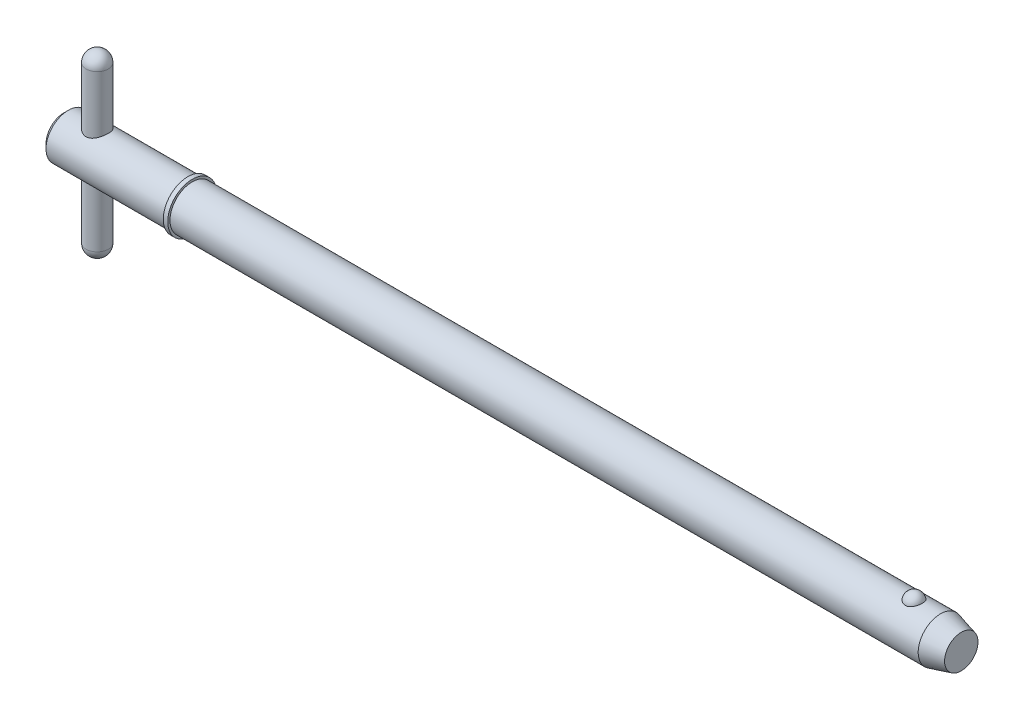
ISO-10303-21;
HEADER;
FILE_DESCRIPTION(('STEP AP214'),'2;1');
FILE_NAME('part.step','',(''),(''),'','','');
FILE_SCHEMA(('AUTOMOTIVE_DESIGN { 1 0 10303 214 1 1 1 1 }'));
ENDSEC;
DATA;
#1=APPLICATION_CONTEXT('core data for automotive mechanical design processes');
#2=APPLICATION_PROTOCOL_DEFINITION('international standard','automotive_design',2000,#1);
#3=PRODUCT_CONTEXT('',#1,'mechanical');
#4=PRODUCT('Part','Part','',(#3));
#5=PRODUCT_RELATED_PRODUCT_CATEGORY('part','',(#4));
#6=PRODUCT_DEFINITION_FORMATION('','',#4);
#7=PRODUCT_DEFINITION_CONTEXT('part definition',#1,'design');
#8=PRODUCT_DEFINITION('design','',#6,#7);
#9=PRODUCT_DEFINITION_SHAPE('','',#8);
#10=(LENGTH_UNIT() NAMED_UNIT(*) SI_UNIT(.MILLI.,.METRE.));
#11=(NAMED_UNIT(*) PLANE_ANGLE_UNIT() SI_UNIT($,.RADIAN.));
#12=(NAMED_UNIT(*) SI_UNIT($,.STERADIAN.) SOLID_ANGLE_UNIT());
#13=UNCERTAINTY_MEASURE_WITH_UNIT(LENGTH_MEASURE(1.E-05),#10,'distance_accuracy_value','');
#14=(GEOMETRIC_REPRESENTATION_CONTEXT(3) GLOBAL_UNCERTAINTY_ASSIGNED_CONTEXT((#13)) GLOBAL_UNIT_ASSIGNED_CONTEXT((#10,
#11,#12)) REPRESENTATION_CONTEXT('',''));
#15=CARTESIAN_POINT('',(0.,0.,0.));
#16=DIRECTION('',(0.,0.,1.));
#17=DIRECTION('',(1.,0.,0.));
#18=AXIS2_PLACEMENT_3D('',#15,#16,#17);
#19=CARTESIAN_POINT('',(4.755,12.7,0.));
#20=DIRECTION('',(0.,-1.,0.));
#21=DIRECTION('',(0.,0.,-1.));
#22=AXIS2_PLACEMENT_3D('',#19,#20,#21);
#23=CYLINDRICAL_SURFACE('',#22,1.585);
#24=CARTESIAN_POINT('',(4.755,-11.115,0.));
#25=DIRECTION('',(0.,-1.,0.));
#26=DIRECTION('',(0.,0.,-1.));
#27=AXIS2_PLACEMENT_3D('',#24,#25,#26);
#28=CIRCLE('',#27,1.585);
#29=CARTESIAN_POINT('',(4.755,-11.115,-1.585));
#30=VERTEX_POINT('',#29);
#31=EDGE_CURVE('P0_E10',#30,#30,#28,.F.);
#32=ORIENTED_EDGE('',*,*,#31,.T.);
#33=EDGE_LOOP('',(#32));
#34=FACE_BOUND('',#33,.T.);
#35=CARTESIAN_POINT('',(4.755,11.115,0.));
#36=DIRECTION('',(0.,-1.,0.));
#37=DIRECTION('',(0.,0.,-1.));
#38=AXIS2_PLACEMENT_3D('',#35,#36,#37);
#39=CIRCLE('',#38,1.585);
#40=CARTESIAN_POINT('',(4.755,11.115,-1.585));
#41=VERTEX_POINT('',#40);
#42=EDGE_CURVE('P0_E21',#41,#41,#39,.T.);
#43=ORIENTED_EDGE('',*,*,#42,.T.);
#44=EDGE_LOOP('',(#43));
#45=FACE_BOUND('',#44,.T.);
#46=ADVANCED_FACE('P0_F14',(#34,#45),#23,.T.);
#47=CARTESIAN_POINT('',(4.755,-11.115,0.));
#48=DIRECTION('',(0.,0.,1.));
#49=DIRECTION('',(1.,0.,0.));
#50=AXIS2_PLACEMENT_3D('',#47,#48,#49);
#51=SPHERICAL_SURFACE('',#50,1.585);
#52=CARTESIAN_POINT('',(4.755,-11.115,0.));
#53=DIRECTION('',(0.,-1.,0.));
#54=DIRECTION('',(0.,0.,-1.));
#55=AXIS2_PLACEMENT_3D('',#52,#53,#54);
#56=SPHERICAL_SURFACE('',#55,1.585);
#57=ORIENTED_EDGE('',*,*,#31,.F.);
#58=EDGE_LOOP('',(#57));
#59=FACE_BOUND('',#58,.T.);
#60=ADVANCED_FACE('P0_F29',(#59),#56,.T.);
#61=CARTESIAN_POINT('',(4.755,11.115,0.));
#62=DIRECTION('',(0.,0.,1.));
#63=DIRECTION('',(1.,0.,0.));
#64=AXIS2_PLACEMENT_3D('',#61,#62,#63);
#65=SPHERICAL_SURFACE('',#64,1.585);
#66=CARTESIAN_POINT('',(4.755,11.115,0.));
#67=DIRECTION('',(0.,-1.,0.));
#68=DIRECTION('',(0.,0.,-1.));
#69=AXIS2_PLACEMENT_3D('',#66,#67,#68);
#70=SPHERICAL_SURFACE('',#69,1.585);
#71=ORIENTED_EDGE('',*,*,#42,.F.);
#72=EDGE_LOOP('',(#71));
#73=FACE_BOUND('',#72,.T.);
#74=ADVANCED_FACE('P0_F16',(#73),#70,.T.);
#75=CLOSED_SHELL('',(#46,#60,#74));
#76=MANIFOLD_SOLID_BREP('P0_B1',#75);
#77=CARTESIAN_POINT('',(0.,0.,0.));
#78=DIRECTION('',(1.,0.,0.));
#79=DIRECTION('',(0.,0.,-1.));
#80=AXIS2_PLACEMENT_3D('',#77,#78,#79);
#81=CYLINDRICAL_SURFACE('',#80,3.175);
#82=CARTESIAN_POINT('',(124.847684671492,0.,0.));
#83=DIRECTION('',(1.,0.,0.));
#84=DIRECTION('',(0.,0.,-1.));
#85=AXIS2_PLACEMENT_3D('',#82,#83,#84);
#86=CIRCLE('',#85,3.175);
#87=CARTESIAN_POINT('',(124.847684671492,0.,-3.175));
#88=VERTEX_POINT('',#87);
#89=EDGE_CURVE('P1_E81',#88,#88,#86,.T.);
#90=ORIENTED_EDGE('',*,*,#89,.F.);
#91=EDGE_LOOP('',(#90));
#92=FACE_BOUND('',#91,.T.);
#93=CARTESIAN_POINT('',(18.29,0.,0.));
#94=DIRECTION('',(1.,0.,0.));
#95=DIRECTION('',(0.,0.,-1.));
#96=AXIS2_PLACEMENT_3D('',#93,#94,#95);
#97=CIRCLE('',#96,3.175);
#98=CARTESIAN_POINT('',(18.29,0.,-3.175));
#99=VERTEX_POINT('',#98);
#100=EDGE_CURVE('P1_E85',#99,#99,#97,.T.);
#101=ORIENTED_EDGE('',*,*,#100,.T.);
#102=EDGE_LOOP('',(#101));
#103=FACE_BOUND('',#102,.T.);
#104=CARTESIAN_POINT('',(121.07572762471,2.92898950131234,1.22541646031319));
#105=CARTESIAN_POINT('',(121.012316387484,2.92899434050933,1.22541146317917));
#106=CARTESIAN_POINT('',(120.948797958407,2.93112688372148,1.22034641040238));
#107=CARTESIAN_POINT('',(120.823530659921,2.93942752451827,1.20020949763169));
#108=CARTESIAN_POINT('',(120.761786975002,2.94560639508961,1.18511092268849));
#109=CARTESIAN_POINT('',(120.642065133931,2.96127115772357,1.1454035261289));
#110=CARTESIAN_POINT('',(120.584077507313,2.97074831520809,1.1208198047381));
#111=CARTESIAN_POINT('',(120.473194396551,2.99197584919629,1.06285154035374));
#112=CARTESIAN_POINT('',(120.420296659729,3.0037252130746,1.02947091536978));
#113=CARTESIAN_POINT('',(120.319268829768,3.02865714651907,0.953674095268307));
#114=CARTESIAN_POINT('',(120.271324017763,3.04187163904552,0.911021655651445));
#115=CARTESIAN_POINT('',(120.183036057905,3.06808741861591,0.8184003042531));
#116=CARTESIAN_POINT('',(120.142695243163,3.08108863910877,0.768429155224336));
#117=CARTESIAN_POINT('',(120.068803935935,3.10614903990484,0.660064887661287));
#118=CARTESIAN_POINT('',(120.035633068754,3.11814104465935,0.601396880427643));
#119=CARTESIAN_POINT('',(119.979119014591,3.13926931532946,0.479026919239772));
#120=CARTESIAN_POINT('',(119.955776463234,3.14840539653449,0.415324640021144));
#121=CARTESIAN_POINT('',(119.919178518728,3.16298160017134,0.283885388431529));
#122=CARTESIAN_POINT('',(119.906040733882,3.16837855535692,0.216110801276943));
#123=CARTESIAN_POINT('',(119.890567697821,3.17475386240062,0.079136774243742));
#124=CARTESIAN_POINT('',(119.888232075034,3.17573236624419,0.00993738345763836));
#125=CARTESIAN_POINT('',(119.894388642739,3.17318075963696,-0.127420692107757));
#126=CARTESIAN_POINT('',(119.902807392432,3.16968122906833,-0.195583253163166));
#127=CARTESIAN_POINT('',(119.930175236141,3.1585790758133,-0.32941342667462));
#128=CARTESIAN_POINT('',(119.949124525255,3.15097637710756,-0.395080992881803));
#129=CARTESIAN_POINT('',(119.997205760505,3.13242485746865,-0.522180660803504));
#130=CARTESIAN_POINT('',(120.026352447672,3.12147119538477,-0.583606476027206));
#131=CARTESIAN_POINT('',(120.094235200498,3.09734973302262,-0.700436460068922));
#132=CARTESIAN_POINT('',(120.132972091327,3.08418174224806,-0.755840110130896));
#133=CARTESIAN_POINT('',(120.219477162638,3.05694884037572,-0.859404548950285));
#134=CARTESIAN_POINT('',(120.267296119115,3.04287919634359,-0.907521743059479));
#135=CARTESIAN_POINT('',(120.370735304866,3.01548927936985,-0.994758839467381));
#136=CARTESIAN_POINT('',(120.426354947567,3.0021689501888,-1.03387941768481));
#137=CARTESIAN_POINT('',(120.542809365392,2.97810316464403,-1.10126594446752));
#138=CARTESIAN_POINT('',(120.603518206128,2.96731170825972,-1.12973256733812));
#139=CARTESIAN_POINT('',(120.729371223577,2.94928934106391,-1.17598467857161));
#140=CARTESIAN_POINT('',(120.794513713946,2.94205708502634,-1.19377420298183));
#141=CARTESIAN_POINT('',(120.923856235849,2.93233065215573,-1.21746387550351));
#142=CARTESIAN_POINT('',(120.987938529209,2.92961621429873,-1.22391763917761));
#143=CARTESIAN_POINT('',(121.116337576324,2.92855752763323,-1.22644976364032));
#144=CARTESIAN_POINT('',(121.180654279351,2.93021238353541,-1.22253024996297));
#145=CARTESIAN_POINT('',(121.305523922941,2.93756851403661,-1.20474140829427));
#146=CARTESIAN_POINT('',(121.366131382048,2.94313790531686,-1.1911962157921));
#147=CARTESIAN_POINT('',(121.484110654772,2.95756226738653,-1.15491492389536));
#148=CARTESIAN_POINT('',(121.541482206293,2.96641750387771,-1.13217808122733));
#149=CARTESIAN_POINT('',(121.652769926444,2.98669918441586,-1.07755083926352));
#150=CARTESIAN_POINT('',(121.706584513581,2.9981771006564,-1.04547308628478));
#151=CARTESIAN_POINT('',(121.808147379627,3.02240235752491,-0.973220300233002));
#152=CARTESIAN_POINT('',(121.855894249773,3.03514999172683,-0.933043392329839));
#153=CARTESIAN_POINT('',(121.946581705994,3.06131230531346,-0.843372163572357));
#154=CARTESIAN_POINT('',(121.989158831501,3.07472822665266,-0.793510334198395));
#155=CARTESIAN_POINT('',(122.065676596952,3.10021106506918,-0.687241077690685));
#156=CARTESIAN_POINT('',(122.099615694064,3.1122777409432,-0.630832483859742));
#157=CARTESIAN_POINT('',(122.159120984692,3.134208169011,-0.511059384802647));
#158=CARTESIAN_POINT('',(122.184389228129,3.14399040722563,-0.447531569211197));
#159=CARTESIAN_POINT('',(122.224511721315,3.15983820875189,-0.316827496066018));
#160=CARTESIAN_POINT('',(122.239365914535,3.16590375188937,-0.249651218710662));
#161=CARTESIAN_POINT('',(122.258358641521,3.17370076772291,-0.113549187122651));
#162=CARTESIAN_POINT('',(122.262496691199,3.17543204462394,-0.0446233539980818));
#163=CARTESIAN_POINT('',(122.259969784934,3.17438372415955,0.09299382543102));
#164=CARTESIAN_POINT('',(122.253305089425,3.17160423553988,0.16168517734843));
#165=CARTESIAN_POINT('',(122.229375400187,3.1618438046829,0.296502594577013));
#166=CARTESIAN_POINT('',(122.212167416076,3.15488546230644,0.362640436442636));
#167=CARTESIAN_POINT('',(122.167547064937,3.13748892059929,0.490896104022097));
#168=CARTESIAN_POINT('',(122.140133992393,3.12705048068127,0.553013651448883));
#169=CARTESIAN_POINT('',(122.075462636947,3.10369139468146,0.671876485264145));
#170=CARTESIAN_POINT('',(122.038146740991,3.0907563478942,0.728587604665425));
#171=CARTESIAN_POINT('',(121.954524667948,3.06381731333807,0.83465359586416));
#172=CARTESIAN_POINT('',(121.908218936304,3.04981337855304,0.884008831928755));
#173=CARTESIAN_POINT('',(121.807718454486,3.02230423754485,0.973916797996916));
#174=CARTESIAN_POINT('',(121.753535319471,3.00879833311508,1.01448227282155));
#175=CARTESIAN_POINT('',(121.638529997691,2.98383625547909,1.08571550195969));
#176=CARTESIAN_POINT('',(121.577705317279,2.97238085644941,1.11637952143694));
#177=CARTESIAN_POINT('',(121.453369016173,2.95329063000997,1.16592590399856));
#178=CARTESIAN_POINT('',(121.390023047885,2.94553738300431,1.1851790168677));
#179=CARTESIAN_POINT('',(121.26076644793,2.9342556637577,1.2128480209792));
#180=CARTESIAN_POINT('',(121.194864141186,2.93071450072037,1.22129647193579));
#181=CARTESIAN_POINT('',(121.111116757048,2.9291525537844,1.22502505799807));
#182=CARTESIAN_POINT('',(121.093426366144,2.9289881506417,1.22541785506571));
#183=CARTESIAN_POINT('',(121.07572762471,2.92898950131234,1.22541646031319));
#184=B_SPLINE_CURVE_WITH_KNOTS('',3,(#104,#105,#106,#107,#108,#109,#110,#111,#112,#113,#114,
#115,#116,#117,#118,#119,#120,#121,#122,#123,#124,#125,#126,#127,#128,#129,#130,#131,#132,#133,
#134,#135,#136,#137,#138,#139,#140,#141,#142,#143,#144,#145,#146,#147,#148,#149,#150,#151,#152,
#153,#154,#155,#156,#157,#158,#159,#160,#161,#162,#163,#164,#165,#166,#167,#168,#169,#170,#171,
#172,#173,#174,#175,#176,#177,#178,#179,#180,#181,#182,#183),.UNSPECIFIED.,.T.,.F.,(4,2,2,2,2,2,
2,2,2,2,2,2,2,2,2,2,2,2,2,2,2,2,2,2,2,2,2,2,2,2,2,2,2,2,2,2,2,2,2,4),(0.,0.19018620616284,
0.380880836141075,0.571074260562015,0.76118311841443,0.956866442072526,1.1526097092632,
1.35701770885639,1.56143892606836,1.76818248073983,1.9749189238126,2.18025109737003,
2.3855870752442,2.59122111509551,2.79687285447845,3.00371012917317,3.21053185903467,
3.41323429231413,3.61586005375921,3.80828192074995,4.0006643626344,4.18685798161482,
4.37306665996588,4.56330302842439,4.75358348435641,4.95345287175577,5.1533579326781,
5.3595700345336,5.56578325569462,5.77200579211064,5.97822335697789,6.18333558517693,
6.38846199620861,6.59480900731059,6.80114579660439,7.00718137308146,7.21329457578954,
7.41228022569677,7.61066481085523,7.66374777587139),.UNSPECIFIED.);
#185=CARTESIAN_POINT('',(121.07572762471,2.92898950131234,1.22541646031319));
#186=VERTEX_POINT('',#185);
#187=EDGE_CURVE('P1_E35',#186,#186,#184,.T.);
#188=ORIENTED_EDGE('',*,*,#187,.T.);
#189=EDGE_LOOP('',(#188));
#190=FACE_BOUND('',#189,.T.);
#191=ADVANCED_FACE('P1_F13',(#92,#103,#190),#81,.T.);
#192=CARTESIAN_POINT('',(0.,0.,0.));
#193=DIRECTION('',(-1.,0.,0.));
#194=DIRECTION('',(0.,0.,1.));
#195=AXIS2_PLACEMENT_3D('',#192,#193,#194);
#196=PLANE('',#195);
#197=CARTESIAN_POINT('',(0.,0.,0.));
#198=DIRECTION('',(1.,0.,0.));
#199=DIRECTION('',(0.,0.,-1.));
#200=AXIS2_PLACEMENT_3D('',#197,#198,#199);
#201=CIRCLE('',#200,2.54);
#202=CARTESIAN_POINT('',(0.,0.,-2.54));
#203=VERTEX_POINT('',#202);
#204=EDGE_CURVE('P1_E9',#203,#203,#201,.T.);
#205=ORIENTED_EDGE('',*,*,#204,.F.);
#206=EDGE_LOOP('',(#205));
#207=FACE_BOUND('',#206,.T.);
#208=ADVANCED_FACE('P1_F15',(#207),#196,.T.);
#209=CARTESIAN_POINT('',(0.634999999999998,0.,0.));
#210=DIRECTION('',(1.,0.,0.));
#211=DIRECTION('',(0.,0.,-1.));
#212=AXIS2_PLACEMENT_3D('',#209,#210,#211);
#213=CONICAL_SURFACE('',#212,3.175,0.78539816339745);
#214=ORIENTED_EDGE('',*,*,#204,.T.);
#215=EDGE_LOOP('',(#214));
#216=FACE_BOUND('',#215,.T.);
#217=CARTESIAN_POINT('',(0.634999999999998,0.,0.));
#218=DIRECTION('',(1.,0.,0.));
#219=DIRECTION('',(0.,0.,-1.));
#220=AXIS2_PLACEMENT_3D('',#217,#218,#219);
#221=CIRCLE('',#220,3.175);
#222=CARTESIAN_POINT('',(0.634999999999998,0.,-3.175));
#223=VERTEX_POINT('',#222);
#224=EDGE_CURVE('P1_E26',#223,#223,#221,.T.);
#225=ORIENTED_EDGE('',*,*,#224,.F.);
#226=EDGE_LOOP('',(#225));
#227=FACE_BOUND('',#226,.T.);
#228=ADVANCED_FACE('P1_F77',(#216,#227),#213,.T.);
#229=CARTESIAN_POINT('',(0.,0.,0.));
#230=DIRECTION('',(1.,0.,0.));
#231=DIRECTION('',(0.,0.,-1.));
#232=AXIS2_PLACEMENT_3D('',#229,#230,#231);
#233=CYLINDRICAL_SURFACE('',#232,3.175);
#234=CARTESIAN_POINT('',(4.755,-2.75107251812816,1.585));
#235=CARTESIAN_POINT('',(4.67238891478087,-2.7510796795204,1.58499425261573));
#236=CARTESIAN_POINT('',(4.58967306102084,-2.75485010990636,1.57849830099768));
#237=CARTESIAN_POINT('',(4.42677850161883,-2.76938647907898,1.55284486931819));
#238=CARTESIAN_POINT('',(4.34660551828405,-2.78016716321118,1.53366069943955));
#239=CARTESIAN_POINT('',(4.19146029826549,-2.80716278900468,1.48366329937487));
#240=CARTESIAN_POINT('',(4.11646293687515,-2.8233488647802,1.45291173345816));
#241=CARTESIAN_POINT('',(3.97271079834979,-2.85928672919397,1.38084067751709));
#242=CARTESIAN_POINT('',(3.90395634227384,-2.87903870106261,1.33952064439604));
#243=CARTESIAN_POINT('',(3.76839976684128,-2.921867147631,1.24350234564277));
#244=CARTESIAN_POINT('',(3.702222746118,-2.94508343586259,1.18798355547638));
#245=CARTESIAN_POINT('',(3.5796334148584,-2.99109588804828,1.06685014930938));
#246=CARTESIAN_POINT('',(3.52322596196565,-3.01389183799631,1.00123054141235));
#247=CARTESIAN_POINT('',(3.41807024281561,-3.05832598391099,0.856373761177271));
#248=CARTESIAN_POINT('',(3.37009053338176,-3.07978367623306,0.776518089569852));
#249=CARTESIAN_POINT('',(3.28853137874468,-3.11730894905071,0.608596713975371));
#250=CARTESIAN_POINT('',(3.25494287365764,-3.1333799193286,0.520536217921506));
#251=CARTESIAN_POINT('',(3.20559401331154,-3.15731341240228,0.345327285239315));
#252=CARTESIAN_POINT('',(3.18873760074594,-3.16567752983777,0.258557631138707));
#253=CARTESIAN_POINT('',(3.16972238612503,-3.17512718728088,0.0830496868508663));
#254=CARTESIAN_POINT('',(3.16755472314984,-3.17621711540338,-0.00568738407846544));
#255=CARTESIAN_POINT('',(3.1775542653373,-3.17123385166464,-0.174372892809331));
#256=CARTESIAN_POINT('',(3.18849502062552,-3.16577346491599,-0.254416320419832));
#257=CARTESIAN_POINT('',(3.22220680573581,-3.14922844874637,-0.411354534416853));
#258=CARTESIAN_POINT('',(3.2449787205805,-3.13814339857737,-0.488249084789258));
#259=CARTESIAN_POINT('',(3.30185558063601,-3.111172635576,-0.638050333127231));
#260=CARTESIAN_POINT('',(3.33611332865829,-3.09522247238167,-0.710886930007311));
#261=CARTESIAN_POINT('',(3.41477890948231,-3.05996035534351,-0.849953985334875));
#262=CARTESIAN_POINT('',(3.45919037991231,-3.04064719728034,-0.916182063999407));
#263=CARTESIAN_POINT('',(3.5617148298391,-2.99832415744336,-1.04681642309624));
#264=CARTESIAN_POINT('',(3.62072497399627,-2.97513741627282,-1.11046186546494));
#265=CARTESIAN_POINT('',(3.7483697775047,-2.92885066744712,-1.22736291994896));
#266=CARTESIAN_POINT('',(3.81701173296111,-2.90575073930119,-1.2806105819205));
#267=CARTESIAN_POINT('',(3.96727993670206,-2.86067370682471,-1.37849835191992));
#268=CARTESIAN_POINT('',(4.04945242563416,-2.83885964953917,-1.42238246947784));
#269=CARTESIAN_POINT('',(4.2213558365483,-2.80110454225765,-1.49537418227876));
#270=CARTESIAN_POINT('',(4.3110787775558,-2.78515738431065,-1.52449715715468));
#271=CARTESIAN_POINT('',(4.48806324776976,-2.76271292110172,-1.56478065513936));
#272=CARTESIAN_POINT('',(4.57495732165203,-2.75556745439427,-1.57718067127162));
#273=CARTESIAN_POINT('',(4.74985771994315,-2.74969306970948,-1.58740564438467));
#274=CARTESIAN_POINT('',(4.8378632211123,-2.75095824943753,-1.58524082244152));
#275=CARTESIAN_POINT('',(5.00227282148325,-2.76107477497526,-1.56753530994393));
#276=CARTESIAN_POINT('',(5.07889680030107,-2.76908515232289,-1.55347662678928));
#277=CARTESIAN_POINT('',(5.22855309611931,-2.79054849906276,-1.51458035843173));
#278=CARTESIAN_POINT('',(5.30158424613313,-2.80400322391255,-1.489739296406));
#279=CARTESIAN_POINT('',(5.44583114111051,-2.83556995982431,-1.42877335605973));
#280=CARTESIAN_POINT('',(5.51680600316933,-2.85386886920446,-1.39217900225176));
#281=CARTESIAN_POINT('',(5.6520174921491,-2.89289503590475,-1.30915485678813));
#282=CARTESIAN_POINT('',(5.71625063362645,-2.91362353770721,-1.26272001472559));
#283=CARTESIAN_POINT('',(5.8445938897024,-2.95830220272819,-1.15451693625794));
#284=CARTESIAN_POINT('',(5.90767560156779,-2.98233004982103,-1.09155543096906));
#285=CARTESIAN_POINT('',(6.0226995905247,-3.02864458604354,-0.955560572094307));
#286=CARTESIAN_POINT('',(6.07463814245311,-3.05093069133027,-0.882523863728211));
#287=CARTESIAN_POINT('',(6.16704288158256,-3.09200671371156,-0.725836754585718));
#288=CARTESIAN_POINT('',(6.20717458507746,-3.11069030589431,-0.64195924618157));
#289=CARTESIAN_POINT('',(6.27235859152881,-3.1416474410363,-0.467442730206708));
#290=CARTESIAN_POINT('',(6.29742409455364,-3.15392659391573,-0.376809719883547));
#291=CARTESIAN_POINT('',(6.32960989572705,-3.16979844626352,-0.200314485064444));
#292=CARTESIAN_POINT('',(6.33816324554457,-3.17408359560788,-0.114775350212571));
#293=CARTESIAN_POINT('',(6.34130309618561,-3.17565001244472,0.0566108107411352));
#294=CARTESIAN_POINT('',(6.33589445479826,-3.17293371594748,0.142457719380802));
#295=CARTESIAN_POINT('',(6.31221457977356,-3.16120608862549,0.306097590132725));
#296=CARTESIAN_POINT('',(6.2948097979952,-3.15261910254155,0.38404960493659));
#297=CARTESIAN_POINT('',(6.24879775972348,-3.13040364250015,0.535801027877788));
#298=CARTESIAN_POINT('',(6.22018889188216,-3.11677444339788,0.609599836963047));
#299=CARTESIAN_POINT('',(6.15130303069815,-3.08497808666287,0.754502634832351));
#300=CARTESIAN_POINT('',(6.11057850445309,-3.0666414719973,0.82535556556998));
#301=CARTESIAN_POINT('',(6.01917980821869,-3.02735012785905,0.95951596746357));
#302=CARTESIAN_POINT('',(5.96850106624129,-3.00639419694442,1.02281994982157));
#303=CARTESIAN_POINT('',(5.8528006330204,-2.96149402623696,1.1467073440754));
#304=CARTESIAN_POINT('',(5.78685463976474,-2.93745961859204,1.20639723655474));
#305=CARTESIAN_POINT('',(5.64552278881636,-2.89084502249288,1.31419099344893));
#306=CARTESIAN_POINT('',(5.57012871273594,-2.8682661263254,1.36228466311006));
#307=CARTESIAN_POINT('',(5.40892145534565,-2.82661780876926,1.44677201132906));
#308=CARTESIAN_POINT('',(5.32285703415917,-2.80767948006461,1.48275497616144));
#309=CARTESIAN_POINT('',(5.14469010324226,-2.77716572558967,1.53916557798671));
#310=CARTESIAN_POINT('',(5.05260892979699,-2.76556569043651,1.55964525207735));
#311=CARTESIAN_POINT('',(4.92544162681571,-2.75613775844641,1.57618070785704));
#312=CARTESIAN_POINT('',(4.89147210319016,-2.75424493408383,1.57948285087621));
#313=CARTESIAN_POINT('',(4.82334103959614,-2.75171079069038,1.58389375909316));
#314=CARTESIAN_POINT('',(4.78917948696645,-2.75106955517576,1.58500237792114));
#315=CARTESIAN_POINT('',(4.755,-2.75107251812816,1.585));
#316=B_SPLINE_CURVE_WITH_KNOTS('',3,(#234,#235,#236,#237,#238,#239,#240,#241,#242,#243,#244,
#245,#246,#247,#248,#249,#250,#251,#252,#253,#254,#255,#256,#257,#258,#259,#260,#261,#262,#263,
#264,#265,#266,#267,#268,#269,#270,#271,#272,#273,#274,#275,#276,#277,#278,#279,#280,#281,#282,
#283,#284,#285,#286,#287,#288,#289,#290,#291,#292,#293,#294,#295,#296,#297,#298,#299,#300,#301,
#302,#303,#304,#305,#306,#307,#308,#309,#310,#311,#312,#313,#314,#315),.UNSPECIFIED.,.T.,.F.,(4,
2,2,2,2,2,2,2,2,2,2,2,2,2,2,2,2,2,2,2,2,2,2,2,2,2,2,2,2,2,2,2,2,2,2,2,2,2,2,2,4),(0.,
0.247689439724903,0.495901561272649,0.742808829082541,0.989728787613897,1.25694656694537,
1.52429683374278,1.80959781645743,2.0947189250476,2.35960564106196,2.62433255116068,
2.86610932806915,3.1079041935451,3.35305262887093,3.59828902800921,3.86665310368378,
4.13522157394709,4.4207514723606,4.70598326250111,4.9686344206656,5.23110127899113,
5.46499114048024,5.69895647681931,5.94376186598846,6.1886932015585,6.46438263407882,
6.74016408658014,7.0231370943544,7.30586181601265,7.5626977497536,7.81944433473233,
8.05935987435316,8.29930993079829,8.54954401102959,8.79989329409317,9.07508848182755,
9.35052473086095,9.63453318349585,9.91758407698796,10.0200561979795,10.1225351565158),.UNSPECIFIED.);
#317=CARTESIAN_POINT('',(4.755,-2.75107251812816,1.585));
#318=VERTEX_POINT('',#317);
#319=EDGE_CURVE('P1_E17',#318,#318,#316,.T.);
#320=ORIENTED_EDGE('',*,*,#319,.F.);
#321=EDGE_LOOP('',(#320));
#322=FACE_BOUND('',#321,.T.);
#323=CARTESIAN_POINT('',(4.755,2.75107251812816,1.585));
#324=CARTESIAN_POINT('',(4.83761108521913,2.7510796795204,1.58499425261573));
#325=CARTESIAN_POINT('',(4.92032693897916,2.75485010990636,1.57849830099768));
#326=CARTESIAN_POINT('',(5.08322149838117,2.76938647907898,1.55284486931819));
#327=CARTESIAN_POINT('',(5.16339448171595,2.78016716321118,1.53366069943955));
#328=CARTESIAN_POINT('',(5.31853970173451,2.80716278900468,1.48366329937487));
#329=CARTESIAN_POINT('',(5.39353706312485,2.8233488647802,1.45291173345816));
#330=CARTESIAN_POINT('',(5.53728920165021,2.85928672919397,1.38084067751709));
#331=CARTESIAN_POINT('',(5.60604365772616,2.87903870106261,1.33952064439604));
#332=CARTESIAN_POINT('',(5.74160023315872,2.921867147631,1.24350234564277));
#333=CARTESIAN_POINT('',(5.807777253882,2.94508343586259,1.18798355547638));
#334=CARTESIAN_POINT('',(5.9303665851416,2.99109588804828,1.06685014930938));
#335=CARTESIAN_POINT('',(5.98677403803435,3.01389183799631,1.00123054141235));
#336=CARTESIAN_POINT('',(6.09192975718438,3.05832598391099,0.85637376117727));
#337=CARTESIAN_POINT('',(6.13990946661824,3.07978367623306,0.776518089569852));
#338=CARTESIAN_POINT('',(6.22146862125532,3.11730894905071,0.608596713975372));
#339=CARTESIAN_POINT('',(6.25505712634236,3.1333799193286,0.520536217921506));
#340=CARTESIAN_POINT('',(6.30440598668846,3.15731341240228,0.345327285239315));
#341=CARTESIAN_POINT('',(6.32126239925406,3.16567752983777,0.258557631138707));
#342=CARTESIAN_POINT('',(6.34027761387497,3.17512718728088,0.0830496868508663));
#343=CARTESIAN_POINT('',(6.34244527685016,3.17621711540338,-0.00568738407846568));
#344=CARTESIAN_POINT('',(6.3324457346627,3.17123385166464,-0.174372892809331));
#345=CARTESIAN_POINT('',(6.32150497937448,3.16577346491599,-0.254416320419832));
#346=CARTESIAN_POINT('',(6.28779319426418,3.14922844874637,-0.411354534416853));
#347=CARTESIAN_POINT('',(6.2650212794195,3.13814339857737,-0.488249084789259));
#348=CARTESIAN_POINT('',(6.20814441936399,3.111172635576,-0.638050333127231));
#349=CARTESIAN_POINT('',(6.17388667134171,3.09522247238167,-0.710886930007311));
#350=CARTESIAN_POINT('',(6.09522109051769,3.05996035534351,-0.849953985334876));
#351=CARTESIAN_POINT('',(6.05080962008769,3.04064719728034,-0.916182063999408));
#352=CARTESIAN_POINT('',(5.9482851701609,2.99832415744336,-1.04681642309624));
#353=CARTESIAN_POINT('',(5.88927502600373,2.97513741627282,-1.11046186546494));
#354=CARTESIAN_POINT('',(5.7616302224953,2.92885066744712,-1.22736291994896));
#355=CARTESIAN_POINT('',(5.69298826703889,2.90575073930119,-1.2806105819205));
#356=CARTESIAN_POINT('',(5.54272006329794,2.86067370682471,-1.37849835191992));
#357=CARTESIAN_POINT('',(5.46054757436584,2.83885964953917,-1.42238246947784));
#358=CARTESIAN_POINT('',(5.2886441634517,2.80110454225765,-1.49537418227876));
#359=CARTESIAN_POINT('',(5.19892122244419,2.78515738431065,-1.52449715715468));
#360=CARTESIAN_POINT('',(5.02193675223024,2.76271292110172,-1.56478065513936));
#361=CARTESIAN_POINT('',(4.93504267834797,2.75556745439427,-1.57718067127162));
#362=CARTESIAN_POINT('',(4.76014228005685,2.74969306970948,-1.58740564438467));
#363=CARTESIAN_POINT('',(4.6721367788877,2.75095824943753,-1.58524082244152));
#364=CARTESIAN_POINT('',(4.50772717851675,2.76107477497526,-1.56753530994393));
#365=CARTESIAN_POINT('',(4.43110319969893,2.76908515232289,-1.55347662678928));
#366=CARTESIAN_POINT('',(4.28144690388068,2.79054849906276,-1.51458035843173));
#367=CARTESIAN_POINT('',(4.20841575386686,2.80400322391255,-1.489739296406));
#368=CARTESIAN_POINT('',(4.06416885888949,2.83556995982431,-1.42877335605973));
#369=CARTESIAN_POINT('',(3.99319399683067,2.85386886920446,-1.39217900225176));
#370=CARTESIAN_POINT('',(3.8579825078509,2.89289503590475,-1.30915485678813));
#371=CARTESIAN_POINT('',(3.79374936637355,2.91362353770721,-1.26272001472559));
#372=CARTESIAN_POINT('',(3.6654061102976,2.95830220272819,-1.15451693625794));
#373=CARTESIAN_POINT('',(3.60232439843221,2.98233004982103,-1.09155543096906));
#374=CARTESIAN_POINT('',(3.4873004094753,3.02864458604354,-0.955560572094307));
#375=CARTESIAN_POINT('',(3.43536185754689,3.05093069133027,-0.88252386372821));
#376=CARTESIAN_POINT('',(3.34295711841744,3.09200671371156,-0.725836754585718));
#377=CARTESIAN_POINT('',(3.30282541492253,3.11069030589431,-0.64195924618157));
#378=CARTESIAN_POINT('',(3.23764140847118,3.14164744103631,-0.467442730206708));
#379=CARTESIAN_POINT('',(3.21257590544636,3.15392659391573,-0.376809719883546));
#380=CARTESIAN_POINT('',(3.18039010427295,3.16979844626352,-0.200314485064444));
#381=CARTESIAN_POINT('',(3.17183675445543,3.17408359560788,-0.114775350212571));
#382=CARTESIAN_POINT('',(3.16869690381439,3.17565001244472,0.0566108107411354));
#383=CARTESIAN_POINT('',(3.17410554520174,3.17293371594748,0.142457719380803));
#384=CARTESIAN_POINT('',(3.19778542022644,3.16120608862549,0.306097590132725));
#385=CARTESIAN_POINT('',(3.2151902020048,3.15261910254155,0.384049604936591));
#386=CARTESIAN_POINT('',(3.26120224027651,3.13040364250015,0.535801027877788));
#387=CARTESIAN_POINT('',(3.28981110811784,3.11677444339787,0.609599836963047));
#388=CARTESIAN_POINT('',(3.35869696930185,3.08497808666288,0.754502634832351));
#389=CARTESIAN_POINT('',(3.39942149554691,3.0666414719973,0.82535556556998));
#390=CARTESIAN_POINT('',(3.49082019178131,3.02735012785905,0.95951596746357));
#391=CARTESIAN_POINT('',(3.54149893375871,3.00639419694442,1.02281994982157));
#392=CARTESIAN_POINT('',(3.6571993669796,2.96149402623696,1.1467073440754));
#393=CARTESIAN_POINT('',(3.72314536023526,2.93745961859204,1.20639723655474));
#394=CARTESIAN_POINT('',(3.86447721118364,2.89084502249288,1.31419099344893));
#395=CARTESIAN_POINT('',(3.93987128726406,2.8682661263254,1.36228466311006));
#396=CARTESIAN_POINT('',(4.10107854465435,2.82661780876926,1.44677201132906));
#397=CARTESIAN_POINT('',(4.18714296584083,2.80767948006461,1.48275497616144));
#398=CARTESIAN_POINT('',(4.36530989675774,2.77716572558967,1.53916557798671));
#399=CARTESIAN_POINT('',(4.45739107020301,2.76556569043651,1.55964525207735));
#400=CARTESIAN_POINT('',(4.58455837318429,2.75613775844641,1.57618070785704));
#401=CARTESIAN_POINT('',(4.61852789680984,2.75424493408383,1.57948285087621));
#402=CARTESIAN_POINT('',(4.68665896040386,2.75171079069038,1.58389375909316));
#403=CARTESIAN_POINT('',(4.72082051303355,2.75106955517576,1.58500237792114));
#404=CARTESIAN_POINT('',(4.755,2.75107251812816,1.585));
#405=B_SPLINE_CURVE_WITH_KNOTS('',3,(#323,#324,#325,#326,#327,#328,#329,#330,#331,#332,#333,
#334,#335,#336,#337,#338,#339,#340,#341,#342,#343,#344,#345,#346,#347,#348,#349,#350,#351,#352,
#353,#354,#355,#356,#357,#358,#359,#360,#361,#362,#363,#364,#365,#366,#367,#368,#369,#370,#371,
#372,#373,#374,#375,#376,#377,#378,#379,#380,#381,#382,#383,#384,#385,#386,#387,#388,#389,#390,
#391,#392,#393,#394,#395,#396,#397,#398,#399,#400,#401,#402,#403,#404),.UNSPECIFIED.,.T.,.F.,(4,
2,2,2,2,2,2,2,2,2,2,2,2,2,2,2,2,2,2,2,2,2,2,2,2,2,2,2,2,2,2,2,2,2,2,2,2,2,2,2,4),(0.,
0.247689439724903,0.495901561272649,0.742808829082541,0.989728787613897,1.25694656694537,
1.52429683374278,1.80959781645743,2.0947189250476,2.35960564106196,2.62433255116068,
2.86610932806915,3.1079041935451,3.35305262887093,3.59828902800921,3.86665310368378,
4.13522157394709,4.4207514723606,4.70598326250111,4.9686344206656,5.23110127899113,
5.46499114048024,5.69895647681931,5.94376186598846,6.1886932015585,6.46438263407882,
6.74016408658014,7.0231370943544,7.30586181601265,7.5626977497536,7.81944433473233,
8.05935987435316,8.29930993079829,8.54954401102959,8.79989329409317,9.07508848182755,
9.35052473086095,9.63453318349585,9.91758407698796,10.0200561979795,10.1225351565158),.UNSPECIFIED.);
#406=CARTESIAN_POINT('',(4.755,2.75107251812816,1.585));
#407=VERTEX_POINT('',#406);
#408=EDGE_CURVE('P1_E43',#407,#407,#405,.T.);
#409=ORIENTED_EDGE('',*,*,#408,.F.);
#410=EDGE_LOOP('',(#409));
#411=FACE_BOUND('',#410,.T.);
#412=ORIENTED_EDGE('',*,*,#224,.T.);
#413=EDGE_LOOP('',(#412));
#414=FACE_BOUND('',#413,.T.);
#415=CARTESIAN_POINT('',(17.655,0.,0.));
#416=DIRECTION('',(1.,0.,0.));
#417=DIRECTION('',(0.,0.,-1.));
#418=AXIS2_PLACEMENT_3D('',#415,#416,#417);
#419=CIRCLE('',#418,3.175);
#420=CARTESIAN_POINT('',(17.655,0.,-3.175));
#421=VERTEX_POINT('',#420);
#422=EDGE_CURVE('P1_E31',#421,#421,#419,.T.);
#423=ORIENTED_EDGE('',*,*,#422,.F.);
#424=EDGE_LOOP('',(#423));
#425=FACE_BOUND('',#424,.T.);
#426=ADVANCED_FACE('P1_F103',(#322,#411,#414,#425),#233,.T.);
#427=CARTESIAN_POINT('',(17.655,3.175,0.));
#428=DIRECTION('',(-1.,0.,0.));
#429=DIRECTION('',(0.,0.,1.));
#430=AXIS2_PLACEMENT_3D('',#427,#428,#429);
#431=PLANE('',#430);
#432=ORIENTED_EDGE('',*,*,#422,.T.);
#433=EDGE_LOOP('',(#432));
#434=FACE_BOUND('',#433,.T.);
#435=CARTESIAN_POINT('',(17.655,0.,0.));
#436=DIRECTION('',(1.,0.,0.));
#437=DIRECTION('',(0.,0.,-1.));
#438=AXIS2_PLACEMENT_3D('',#435,#436,#437);
#439=CIRCLE('',#438,3.4925);
#440=CARTESIAN_POINT('',(17.655,0.,-3.4925));
#441=VERTEX_POINT('',#440);
#442=EDGE_CURVE('P1_E91',#441,#441,#439,.T.);
#443=ORIENTED_EDGE('',*,*,#442,.F.);
#444=EDGE_LOOP('',(#443));
#445=FACE_BOUND('',#444,.T.);
#446=ADVANCED_FACE('P1_F100',(#434,#445),#431,.T.);
#447=CARTESIAN_POINT('',(0.,0.,0.));
#448=DIRECTION('',(1.,0.,0.));
#449=DIRECTION('',(0.,0.,-1.));
#450=AXIS2_PLACEMENT_3D('',#447,#448,#449);
#451=CYLINDRICAL_SURFACE('',#450,3.4925);
#452=ORIENTED_EDGE('',*,*,#442,.T.);
#453=EDGE_LOOP('',(#452));
#454=FACE_BOUND('',#453,.T.);
#455=CARTESIAN_POINT('',(18.29,0.,0.));
#456=DIRECTION('',(1.,0.,0.));
#457=DIRECTION('',(0.,0.,-1.));
#458=AXIS2_PLACEMENT_3D('',#455,#456,#457);
#459=CIRCLE('',#458,3.4925);
#460=CARTESIAN_POINT('',(18.29,0.,-3.4925));
#461=VERTEX_POINT('',#460);
#462=EDGE_CURVE('P1_E88',#461,#461,#459,.T.);
#463=ORIENTED_EDGE('',*,*,#462,.F.);
#464=EDGE_LOOP('',(#463));
#465=FACE_BOUND('',#464,.T.);
#466=ADVANCED_FACE('P1_F68',(#454,#465),#451,.T.);
#467=CARTESIAN_POINT('',(18.29,3.4925,0.));
#468=DIRECTION('',(1.,0.,0.));
#469=DIRECTION('',(0.,0.,-1.));
#470=AXIS2_PLACEMENT_3D('',#467,#468,#469);
#471=PLANE('',#470);
#472=ORIENTED_EDGE('',*,*,#462,.T.);
#473=EDGE_LOOP('',(#472));
#474=FACE_BOUND('',#473,.T.);
#475=ORIENTED_EDGE('',*,*,#100,.F.);
#476=EDGE_LOOP('',(#475));
#477=FACE_BOUND('',#476,.T.);
#478=ADVANCED_FACE('P1_F62',(#474,#477),#471,.T.);
#479=CARTESIAN_POINT('',(127.81,0.,0.));
#480=DIRECTION('',(-1.,0.,0.));
#481=DIRECTION('',(0.,0.,1.));
#482=AXIS2_PLACEMENT_3D('',#479,#480,#481);
#483=CONICAL_SURFACE('',#482,2.38125000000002,0.261799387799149);
#484=ORIENTED_EDGE('',*,*,#89,.T.);
#485=EDGE_LOOP('',(#484));
#486=FACE_BOUND('',#485,.T.);
#487=CARTESIAN_POINT('',(127.81,0.,0.));
#488=DIRECTION('',(1.,0.,0.));
#489=DIRECTION('',(0.,0.,-1.));
#490=AXIS2_PLACEMENT_3D('',#487,#488,#489);
#491=CIRCLE('',#490,2.38125000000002);
#492=CARTESIAN_POINT('',(127.81,0.,-2.38125000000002));
#493=VERTEX_POINT('',#492);
#494=EDGE_CURVE('P1_E42',#493,#493,#491,.T.);
#495=ORIENTED_EDGE('',*,*,#494,.F.);
#496=EDGE_LOOP('',(#495));
#497=FACE_BOUND('',#496,.T.);
#498=ADVANCED_FACE('P1_F59',(#486,#497),#483,.T.);
#499=CARTESIAN_POINT('',(127.81,2.38125000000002,0.));
#500=DIRECTION('',(1.,0.,0.));
#501=DIRECTION('',(0.,0.,-1.));
#502=AXIS2_PLACEMENT_3D('',#499,#500,#501);
#503=PLANE('',#502);
#504=ORIENTED_EDGE('',*,*,#494,.T.);
#505=EDGE_LOOP('',(#504));
#506=FACE_BOUND('',#505,.T.);
#507=ADVANCED_FACE('P1_F55',(#506),#503,.T.);
#508=CARTESIAN_POINT('',(121.07572762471,2.8575,0.));
#509=DIRECTION('',(-1.,0.,0.));
#510=DIRECTION('',(0.,1.,0.));
#511=AXIS2_PLACEMENT_3D('',#508,#509,#510);
#512=SPHERICAL_SURFACE('',#511,1.22749999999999);
#513=ORIENTED_EDGE('',*,*,#187,.F.);
#514=EDGE_LOOP('',(#513));
#515=FACE_BOUND('',#514,.T.);
#516=ADVANCED_FACE('P1_F50',(#515),#512,.T.);
#517=CARTESIAN_POINT('',(4.755,-3.4925,0.));
#518=DIRECTION('',(0.,1.,0.));
#519=DIRECTION('',(0.,0.,1.));
#520=AXIS2_PLACEMENT_3D('',#517,#518,#519);
#521=CYLINDRICAL_SURFACE('',#520,1.585);
#522=ORIENTED_EDGE('',*,*,#319,.T.);
#523=EDGE_LOOP('',(#522));
#524=FACE_BOUND('',#523,.T.);
#525=ORIENTED_EDGE('',*,*,#408,.T.);
#526=EDGE_LOOP('',(#525));
#527=FACE_BOUND('',#526,.T.);
#528=ADVANCED_FACE('P1_F54',(#524,#527),#521,.F.);
#529=CLOSED_SHELL('',(#191,#208,#228,#426,#446,#466,#478,#498,#507,#516,#528));
#530=MANIFOLD_SOLID_BREP('P1_B1',#529);
#531=ADVANCED_BREP_SHAPE_REPRESENTATION('',(#18,#76,#530),#14);
#532=SHAPE_DEFINITION_REPRESENTATION(#9,#531);
ENDSEC;
END-ISO-10303-21;
